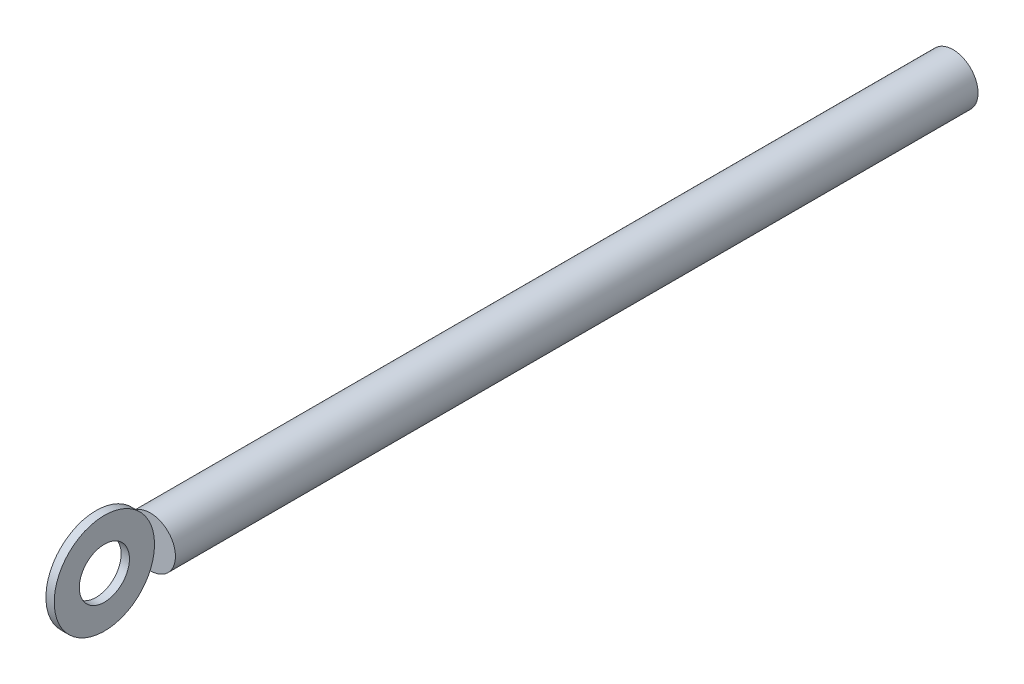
ISO-10303-21;
HEADER;
FILE_DESCRIPTION(('STEP AP214'),'2;1');
FILE_NAME('part.step','',(''),(''),'','','');
FILE_SCHEMA(('AUTOMOTIVE_DESIGN { 1 0 10303 214 1 1 1 1 }'));
ENDSEC;
DATA;
#1=APPLICATION_CONTEXT('core data for automotive mechanical design processes');
#2=APPLICATION_PROTOCOL_DEFINITION('international standard','automotive_design',2000,#1);
#3=PRODUCT_CONTEXT('',#1,'mechanical');
#4=PRODUCT('Part','Part','',(#3));
#5=PRODUCT_RELATED_PRODUCT_CATEGORY('part','',(#4));
#6=PRODUCT_DEFINITION_FORMATION('','',#4);
#7=PRODUCT_DEFINITION_CONTEXT('part definition',#1,'design');
#8=PRODUCT_DEFINITION('design','',#6,#7);
#9=PRODUCT_DEFINITION_SHAPE('','',#8);
#10=(LENGTH_UNIT() NAMED_UNIT(*) SI_UNIT(.MILLI.,.METRE.));
#11=(NAMED_UNIT(*) PLANE_ANGLE_UNIT() SI_UNIT($,.RADIAN.));
#12=(NAMED_UNIT(*) SI_UNIT($,.STERADIAN.) SOLID_ANGLE_UNIT());
#13=UNCERTAINTY_MEASURE_WITH_UNIT(LENGTH_MEASURE(1.E-05),#10,'distance_accuracy_value','');
#14=(GEOMETRIC_REPRESENTATION_CONTEXT(3) GLOBAL_UNCERTAINTY_ASSIGNED_CONTEXT((#13)) GLOBAL_UNIT_ASSIGNED_CONTEXT((#10,
#11,#12)) REPRESENTATION_CONTEXT('',''));
#15=CARTESIAN_POINT('',(0.,0.,0.));
#16=DIRECTION('',(0.,0.,1.));
#17=DIRECTION('',(1.,0.,0.));
#18=AXIS2_PLACEMENT_3D('',#15,#16,#17);
#19=CARTESIAN_POINT('',(0.7874,0.,85.725));
#20=DIRECTION('',(-1.,0.,0.));
#21=DIRECTION('',(0.,0.,1.));
#22=AXIS2_PLACEMENT_3D('',#19,#20,#21);
#23=CYLINDRICAL_SURFACE('',#22,9.52500000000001);
#24=CARTESIAN_POINT('',(0.7874,0.,85.725));
#25=DIRECTION('',(1.,0.,0.));
#26=DIRECTION('',(0.,0.,-1.));
#27=AXIS2_PLACEMENT_3D('',#24,#25,#26);
#28=CIRCLE('',#27,9.52500000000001);
#29=CARTESIAN_POINT('',(0.7874,0.,76.2));
#30=VERTEX_POINT('',#29);
#31=EDGE_CURVE('E11',#30,#30,#28,.T.);
#32=ORIENTED_EDGE('',*,*,#31,.F.);
#33=EDGE_LOOP('',(#32));
#34=FACE_BOUND('',#33,.T.);
#35=CARTESIAN_POINT('',(-0.7874,0.,85.725));
#36=DIRECTION('',(1.,0.,0.));
#37=DIRECTION('',(0.,0.,-1.));
#38=AXIS2_PLACEMENT_3D('',#35,#36,#37);
#39=CIRCLE('',#38,9.52500000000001);
#40=CARTESIAN_POINT('',(-0.7874,0.,76.2));
#41=VERTEX_POINT('',#40);
#42=EDGE_CURVE('E50',#41,#41,#39,.T.);
#43=ORIENTED_EDGE('',*,*,#42,.T.);
#44=EDGE_LOOP('',(#43));
#45=FACE_BOUND('',#44,.T.);
#46=ADVANCED_FACE('F44',(#34,#45),#23,.T.);
#47=CARTESIAN_POINT('',(0.7874,0.,85.725));
#48=DIRECTION('',(1.,0.,0.));
#49=DIRECTION('',(0.,0.,-1.));
#50=AXIS2_PLACEMENT_3D('',#47,#48,#49);
#51=PLANE('',#50);
#52=CARTESIAN_POINT('',(0.7874,0.,85.725));
#53=DIRECTION('',(1.,0.,0.));
#54=DIRECTION('',(0.,0.,-1.));
#55=AXIS2_PLACEMENT_3D('',#52,#53,#54);
#56=CIRCLE('',#55,4.7625);
#57=CARTESIAN_POINT('',(0.7874,0.,80.9625));
#58=VERTEX_POINT('',#57);
#59=EDGE_CURVE('E54',#58,#58,#56,.T.);
#60=ORIENTED_EDGE('',*,*,#59,.F.);
#61=EDGE_LOOP('',(#60));
#62=FACE_BOUND('',#61,.T.);
#63=ORIENTED_EDGE('',*,*,#31,.T.);
#64=EDGE_LOOP('',(#63));
#65=FACE_BOUND('',#64,.T.);
#66=ADVANCED_FACE('F69',(#62,#65),#51,.T.);
#67=CARTESIAN_POINT('',(-0.7874,0.,85.725));
#68=DIRECTION('',(1.,0.,0.));
#69=DIRECTION('',(0.,0.,-1.));
#70=AXIS2_PLACEMENT_3D('',#67,#68,#69);
#71=PLANE('',#70);
#72=CARTESIAN_POINT('',(-0.7874,0.,85.725));
#73=DIRECTION('',(-1.,0.,0.));
#74=DIRECTION('',(0.,0.,1.));
#75=AXIS2_PLACEMENT_3D('',#72,#73,#74);
#76=CIRCLE('',#75,4.7625);
#77=CARTESIAN_POINT('',(-0.7874,0.,90.4875));
#78=VERTEX_POINT('',#77);
#79=EDGE_CURVE('E58',#78,#78,#76,.T.);
#80=ORIENTED_EDGE('',*,*,#79,.F.);
#81=EDGE_LOOP('',(#80));
#82=FACE_BOUND('',#81,.T.);
#83=ORIENTED_EDGE('',*,*,#42,.F.);
#84=EDGE_LOOP('',(#83));
#85=FACE_BOUND('',#84,.T.);
#86=ADVANCED_FACE('F66',(#82,#85),#71,.F.);
#87=CARTESIAN_POINT('',(4.7625,0.,85.725));
#88=DIRECTION('',(-1.,0.,0.));
#89=DIRECTION('',(0.,0.,1.));
#90=AXIS2_PLACEMENT_3D('',#87,#88,#89);
#91=CYLINDRICAL_SURFACE('',#90,4.7625);
#92=ORIENTED_EDGE('',*,*,#59,.T.);
#93=EDGE_LOOP('',(#92));
#94=FACE_BOUND('',#93,.T.);
#95=ORIENTED_EDGE('',*,*,#79,.T.);
#96=EDGE_LOOP('',(#95));
#97=FACE_BOUND('',#96,.T.);
#98=ADVANCED_FACE('F64',(#94,#97),#91,.F.);
#99=CLOSED_SHELL('',(#46,#66,#86,#98));
#100=MANIFOLD_SOLID_BREP('B2',#99);
#101=CARTESIAN_POINT('',(0.,0.,76.2));
#102=DIRECTION('',(0.,0.,-1.));
#103=DIRECTION('',(-1.,0.,0.));
#104=AXIS2_PLACEMENT_3D('',#101,#102,#103);
#105=CYLINDRICAL_SURFACE('',#104,4.7625);
#106=CARTESIAN_POINT('',(0.,0.,76.2));
#107=DIRECTION('',(0.,0.,1.));
#108=DIRECTION('',(1.,0.,0.));
#109=AXIS2_PLACEMENT_3D('',#106,#107,#108);
#110=CIRCLE('',#109,4.7625);
#111=CARTESIAN_POINT('',(-4.7625,0.,76.2));
#112=VERTEX_POINT('',#111);
#113=EDGE_CURVE('E43',#112,#112,#110,.T.);
#114=CARTESIAN_POINT('',(0.,0.,-76.2));
#115=DIRECTION('',(0.,0.,1.));
#116=DIRECTION('',(1.,0.,0.));
#117=AXIS2_PLACEMENT_3D('',#114,#115,#116);
#118=CIRCLE('',#117,4.7625);
#119=CARTESIAN_POINT('',(-4.7625,0.,-76.2));
#120=VERTEX_POINT('',#119);
#121=EDGE_CURVE('E112',#120,#120,#118,.T.);
#122=CARTESIAN_POINT('',(-4.7625,0.,76.2));
#123=CARTESIAN_POINT('',(-4.7625,0.,74.6125));
#124=CARTESIAN_POINT('',(-4.7625,0.,73.025));
#125=CARTESIAN_POINT('',(-4.7625,0.,69.85));
#126=CARTESIAN_POINT('',(-4.7625,0.,68.2625));
#127=CARTESIAN_POINT('',(-4.7625,0.,65.0875));
#128=CARTESIAN_POINT('',(-4.7625,0.,63.5));
#129=CARTESIAN_POINT('',(-4.7625,0.,60.325));
#130=CARTESIAN_POINT('',(-4.7625,0.,58.7375));
#131=CARTESIAN_POINT('',(-4.7625,0.,55.5625));
#132=CARTESIAN_POINT('',(-4.7625,0.,53.975));
#133=CARTESIAN_POINT('',(-4.7625,0.,50.8));
#134=CARTESIAN_POINT('',(-4.7625,0.,49.2125));
#135=CARTESIAN_POINT('',(-4.7625,0.,46.0375));
#136=CARTESIAN_POINT('',(-4.7625,0.,44.45));
#137=CARTESIAN_POINT('',(-4.7625,0.,41.275));
#138=CARTESIAN_POINT('',(-4.7625,0.,39.6875));
#139=CARTESIAN_POINT('',(-4.7625,0.,36.5125));
#140=CARTESIAN_POINT('',(-4.7625,0.,34.925));
#141=CARTESIAN_POINT('',(-4.7625,0.,31.75));
#142=CARTESIAN_POINT('',(-4.7625,0.,30.1625));
#143=CARTESIAN_POINT('',(-4.7625,0.,26.9875));
#144=CARTESIAN_POINT('',(-4.7625,0.,25.4));
#145=CARTESIAN_POINT('',(-4.7625,0.,22.225));
#146=CARTESIAN_POINT('',(-4.7625,0.,20.6375));
#147=CARTESIAN_POINT('',(-4.7625,0.,17.4625));
#148=CARTESIAN_POINT('',(-4.7625,0.,15.875));
#149=CARTESIAN_POINT('',(-4.7625,0.,12.7));
#150=CARTESIAN_POINT('',(-4.7625,0.,11.1125));
#151=CARTESIAN_POINT('',(-4.7625,0.,7.93749999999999));
#152=CARTESIAN_POINT('',(-4.7625,0.,6.34999999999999));
#153=CARTESIAN_POINT('',(-4.7625,0.,3.17499999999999));
#154=CARTESIAN_POINT('',(-4.7625,0.,1.58749999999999));
#155=CARTESIAN_POINT('',(-4.7625,0.,-1.58750000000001));
#156=CARTESIAN_POINT('',(-4.7625,0.,-3.17500000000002));
#157=CARTESIAN_POINT('',(-4.7625,0.,-6.35000000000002));
#158=CARTESIAN_POINT('',(-4.7625,0.,-7.93750000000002));
#159=CARTESIAN_POINT('',(-4.7625,0.,-11.1125));
#160=CARTESIAN_POINT('',(-4.7625,0.,-12.7));
#161=CARTESIAN_POINT('',(-4.7625,0.,-15.875));
#162=CARTESIAN_POINT('',(-4.7625,0.,-17.4625));
#163=CARTESIAN_POINT('',(-4.7625,0.,-20.6375));
#164=CARTESIAN_POINT('',(-4.7625,0.,-22.225));
#165=CARTESIAN_POINT('',(-4.7625,0.,-25.4));
#166=CARTESIAN_POINT('',(-4.7625,0.,-26.9875));
#167=CARTESIAN_POINT('',(-4.7625,0.,-30.1625));
#168=CARTESIAN_POINT('',(-4.7625,0.,-31.75));
#169=CARTESIAN_POINT('',(-4.7625,0.,-34.925));
#170=CARTESIAN_POINT('',(-4.7625,0.,-36.5125));
#171=CARTESIAN_POINT('',(-4.7625,0.,-39.6875));
#172=CARTESIAN_POINT('',(-4.7625,0.,-41.275));
#173=CARTESIAN_POINT('',(-4.7625,0.,-44.45));
#174=CARTESIAN_POINT('',(-4.7625,0.,-46.0375));
#175=CARTESIAN_POINT('',(-4.7625,0.,-49.2125));
#176=CARTESIAN_POINT('',(-4.7625,0.,-50.8));
#177=CARTESIAN_POINT('',(-4.7625,0.,-53.975));
#178=CARTESIAN_POINT('',(-4.7625,0.,-55.5625));
#179=CARTESIAN_POINT('',(-4.7625,0.,-58.7375));
#180=CARTESIAN_POINT('',(-4.7625,0.,-60.325));
#181=CARTESIAN_POINT('',(-4.7625,0.,-63.5));
#182=CARTESIAN_POINT('',(-4.7625,0.,-65.0875));
#183=CARTESIAN_POINT('',(-4.7625,0.,-68.2625));
#184=CARTESIAN_POINT('',(-4.7625,0.,-69.85));
#185=CARTESIAN_POINT('',(-4.7625,0.,-73.025));
#186=CARTESIAN_POINT('',(-4.7625,0.,-74.6125));
#187=CARTESIAN_POINT('',(-4.7625,0.,-76.2));
#188=B_SPLINE_CURVE_WITH_KNOTS('',3,(#122,#123,#124,#125,#126,#127,#128,#129,#130,#131,#132,
#133,#134,#135,#136,#137,#138,#139,#140,#141,#142,#143,#144,#145,#146,#147,#148,#149,#150,#151,
#152,#153,#154,#155,#156,#157,#158,#159,#160,#161,#162,#163,#164,#165,#166,#167,#168,#169,#170,
#171,#172,#173,#174,#175,#176,#177,#178,#179,#180,#181,#182,#183,#184,#185,#186,#187),
.UNSPECIFIED.,.F.,.F.,(4,2,2,2,2,2,2,2,2,2,2,2,2,2,2,2,2,2,2,2,2,2,2,2,2,2,2,2,2,2,2,2,4),(0.,
4.76249999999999,9.52499999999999,14.2875,19.05,23.8125,28.575,33.3375,38.1,42.8625,47.625,
52.3875,57.15,61.9125,66.675,71.4375,76.2,80.9625,85.725,90.4875,95.25,100.0125,104.775,
109.5375,114.3,119.0625,123.825,128.5875,133.35,138.1125,142.875,147.6375,152.4),.UNSPECIFIED.);
#189=EDGE_CURVE('BSEAM106',#112,#120,#188,.T.);
#190=ORIENTED_EDGE('',*,*,#113,.F.);
#191=ORIENTED_EDGE('',*,*,#121,.T.);
#192=ORIENTED_EDGE('',*,*,#189,.T.);
#193=ORIENTED_EDGE('',*,*,#189,.F.);
#194=EDGE_LOOP('',(#190,#192,#191,#193));
#195=FACE_BOUND('',#194,.T.);
#196=ADVANCED_FACE('F106',(#195),#105,.T.);
#197=CARTESIAN_POINT('',(0.,0.,76.2));
#198=DIRECTION('',(0.,0.,1.));
#199=DIRECTION('',(1.,0.,0.));
#200=AXIS2_PLACEMENT_3D('',#197,#198,#199);
#201=PLANE('',#200);
#202=ORIENTED_EDGE('',*,*,#113,.T.);
#203=EDGE_LOOP('',(#202));
#204=FACE_BOUND('',#203,.T.);
#205=ADVANCED_FACE('F121',(#204),#201,.T.);
#206=CARTESIAN_POINT('',(0.,0.,-76.2));
#207=DIRECTION('',(0.,0.,1.));
#208=DIRECTION('',(1.,0.,0.));
#209=AXIS2_PLACEMENT_3D('',#206,#207,#208);
#210=PLANE('',#209);
#211=ORIENTED_EDGE('',*,*,#121,.F.);
#212=EDGE_LOOP('',(#211));
#213=FACE_BOUND('',#212,.T.);
#214=ADVANCED_FACE('F119',(#213),#210,.F.);
#215=CLOSED_SHELL('',(#196,#205,#214));
#216=MANIFOLD_SOLID_BREP('B6',#215);
#217=ADVANCED_BREP_SHAPE_REPRESENTATION('',(#18,#100,#216),#14);
#218=SHAPE_DEFINITION_REPRESENTATION(#9,#217);
ENDSEC;
END-ISO-10303-21;
